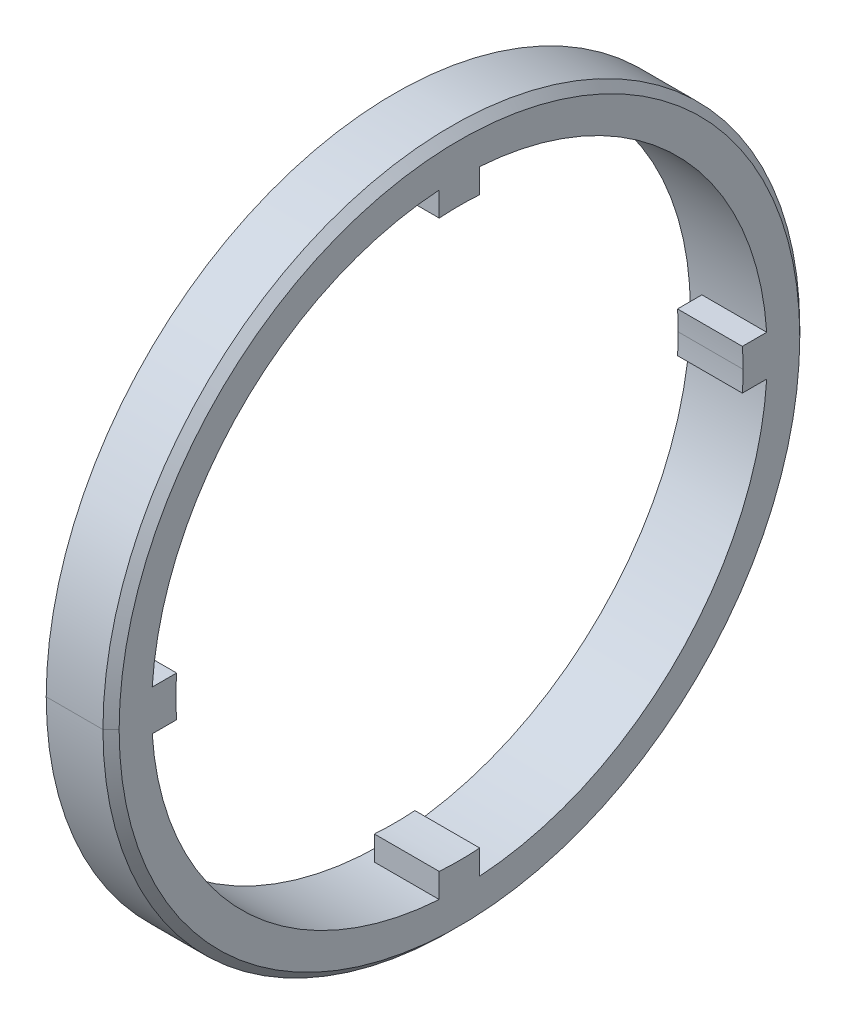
ISO-10303-21;
HEADER;
FILE_DESCRIPTION(('STEP AP214'),'2;1');
FILE_NAME('part.step','',(''),(''),'','','');
FILE_SCHEMA(('AUTOMOTIVE_DESIGN { 1 0 10303 214 1 1 1 1 }'));
ENDSEC;
DATA;
#1=APPLICATION_CONTEXT('core data for automotive mechanical design processes');
#2=APPLICATION_PROTOCOL_DEFINITION('international standard','automotive_design',2000,#1);
#3=PRODUCT_CONTEXT('',#1,'mechanical');
#4=PRODUCT('Part','Part','',(#3));
#5=PRODUCT_RELATED_PRODUCT_CATEGORY('part','',(#4));
#6=PRODUCT_DEFINITION_FORMATION('','',#4);
#7=PRODUCT_DEFINITION_CONTEXT('part definition',#1,'design');
#8=PRODUCT_DEFINITION('design','',#6,#7);
#9=PRODUCT_DEFINITION_SHAPE('','',#8);
#10=(LENGTH_UNIT() NAMED_UNIT(*) SI_UNIT(.MILLI.,.METRE.));
#11=(NAMED_UNIT(*) PLANE_ANGLE_UNIT() SI_UNIT($,.RADIAN.));
#12=(NAMED_UNIT(*) SI_UNIT($,.STERADIAN.) SOLID_ANGLE_UNIT());
#13=UNCERTAINTY_MEASURE_WITH_UNIT(LENGTH_MEASURE(1.E-05),#10,'distance_accuracy_value','');
#14=(GEOMETRIC_REPRESENTATION_CONTEXT(3) GLOBAL_UNCERTAINTY_ASSIGNED_CONTEXT((#13)) GLOBAL_UNIT_ASSIGNED_CONTEXT((#10,
#11,#12)) REPRESENTATION_CONTEXT('',''));
#15=CARTESIAN_POINT('',(0.,0.,0.));
#16=DIRECTION('',(0.,0.,1.));
#17=DIRECTION('',(1.,0.,0.));
#18=AXIS2_PLACEMENT_3D('',#15,#16,#17);
#19=CARTESIAN_POINT('',(-16.,0.,0.));
#20=DIRECTION('',(1.,0.,0.));
#21=DIRECTION('',(0.,1.,0.));
#22=AXIS2_PLACEMENT_3D('',#19,#20,#21);
#23=PLANE('',#22);
#24=CARTESIAN_POINT('',(-16.,0.,0.));
#25=DIRECTION('',(-1.,0.,0.));
#26=DIRECTION('',(0.,1.,0.));
#27=AXIS2_PLACEMENT_3D('',#24,#25,#26);
#28=CIRCLE('',#27,70.);
#29=CARTESIAN_POINT('',(-16.,-4.99999999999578,69.821200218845));
#30=VERTEX_POINT('',#29);
#31=CARTESIAN_POINT('',(-16.,5.00000000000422,69.8212002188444));
#32=VERTEX_POINT('',#31);
#33=EDGE_CURVE('E20',#30,#32,#28,.T.);
#34=ORIENTED_EDGE('',*,*,#33,.F.);
#35=DIRECTION('',(0.,0.,-1.));
#36=VECTOR('',#35,1.);
#37=CARTESIAN_POINT('',(-16.,-4.99999999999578,69.821200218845));
#38=LINE('',#37,#36);
#39=CARTESIAN_POINT('',(-16.,-4.99999999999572,75.8353479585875));
#40=VERTEX_POINT('',#39);
#41=EDGE_CURVE('E26',#40,#30,#38,.T.);
#42=ORIENTED_EDGE('',*,*,#41,.F.);
#43=CARTESIAN_POINT('',(-16.,0.,0.));
#44=DIRECTION('',(1.,0.,0.));
#45=DIRECTION('',(0.,1.,0.));
#46=AXIS2_PLACEMENT_3D('',#43,#44,#45);
#47=CIRCLE('',#46,76.);
#48=CARTESIAN_POINT('',(-16.,0.,76.));
#49=VERTEX_POINT('',#48);
#50=EDGE_CURVE('E313',#49,#40,#47,.T.);
#51=ORIENTED_EDGE('',*,*,#50,.F.);
#52=CARTESIAN_POINT('',(-16.,0.,0.));
#53=DIRECTION('',(1.,0.,0.));
#54=DIRECTION('',(0.,1.,0.));
#55=AXIS2_PLACEMENT_3D('',#52,#53,#54);
#56=CIRCLE('',#55,76.);
#57=CARTESIAN_POINT('',(-16.,5.00000000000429,75.8353479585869));
#58=VERTEX_POINT('',#57);
#59=EDGE_CURVE('E443',#58,#49,#56,.T.);
#60=ORIENTED_EDGE('',*,*,#59,.F.);
#61=DIRECTION('',(0.,0.,1.));
#62=VECTOR('',#61,1.);
#63=CARTESIAN_POINT('',(-16.,5.00000000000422,69.8212002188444));
#64=LINE('',#63,#62);
#65=EDGE_CURVE('E11',#32,#58,#64,.T.);
#66=ORIENTED_EDGE('',*,*,#65,.F.);
#67=EDGE_LOOP('',(#34,#42,#51,#60,#66));
#68=FACE_BOUND('',#67,.T.);
#69=ADVANCED_FACE('F17',(#68),#23,.F.);
#70=CARTESIAN_POINT('',(-16.,5.00000000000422,69.8212002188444));
#71=DIRECTION('',(0.,1.,0.));
#72=DIRECTION('',(0.,0.,-1.));
#73=AXIS2_PLACEMENT_3D('',#70,#71,#72);
#74=PLANE('',#73);
#75=DIRECTION('',(0.,0.,1.));
#76=VECTOR('',#75,1.);
#77=CARTESIAN_POINT('',(0.,5.00000000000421,69.8212002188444));
#78=LINE('',#77,#76);
#79=CARTESIAN_POINT('',(0.,5.00000000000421,69.8212002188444));
#80=VERTEX_POINT('',#79);
#81=CARTESIAN_POINT('',(1.94289029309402E-13,5.00000000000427,75.8353479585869));
#82=VERTEX_POINT('',#81);
#83=EDGE_CURVE('E293',#80,#82,#78,.T.);
#84=ORIENTED_EDGE('',*,*,#83,.F.);
#85=DIRECTION('',(1.,0.,0.));
#86=VECTOR('',#85,1.);
#87=CARTESIAN_POINT('',(-16.,5.00000000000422,69.8212002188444));
#88=LINE('',#87,#86);
#89=EDGE_CURVE('E272',#32,#80,#88,.T.);
#90=ORIENTED_EDGE('',*,*,#89,.F.);
#91=ORIENTED_EDGE('',*,*,#65,.T.);
#92=DIRECTION('',(1.,0.,0.));
#93=VECTOR('',#92,1.);
#94=CARTESIAN_POINT('',(-16.,5.00000000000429,75.8353479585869));
#95=LINE('',#94,#93);
#96=EDGE_CURVE('E439',#58,#82,#95,.T.);
#97=ORIENTED_EDGE('',*,*,#96,.T.);
#98=EDGE_LOOP('',(#84,#90,#91,#97));
#99=FACE_BOUND('',#98,.T.);
#100=ADVANCED_FACE('F583',(#99),#74,.T.);
#101=CARTESIAN_POINT('',(-16.,-4.99999999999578,69.821200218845));
#102=DIRECTION('',(0.,-1.,0.));
#103=DIRECTION('',(-1.,0.,0.));
#104=AXIS2_PLACEMENT_3D('',#101,#102,#103);
#105=PLANE('',#104);
#106=DIRECTION('',(0.,0.,-1.));
#107=VECTOR('',#106,1.);
#108=CARTESIAN_POINT('',(1.11022302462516E-13,-4.99999999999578,69.821200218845));
#109=LINE('',#108,#107);
#110=CARTESIAN_POINT('',(1.11022302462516E-13,-4.99999999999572,75.8353479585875));
#111=VERTEX_POINT('',#110);
#112=CARTESIAN_POINT('',(1.11022302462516E-13,-4.99999999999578,69.821200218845));
#113=VERTEX_POINT('',#112);
#114=EDGE_CURVE('E294',#111,#113,#109,.T.);
#115=ORIENTED_EDGE('',*,*,#114,.F.);
#116=DIRECTION('',(1.,0.,0.));
#117=VECTOR('',#116,1.);
#118=CARTESIAN_POINT('',(-16.,-4.99999999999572,75.8353479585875));
#119=LINE('',#118,#117);
#120=EDGE_CURVE('E309',#40,#111,#119,.T.);
#121=ORIENTED_EDGE('',*,*,#120,.F.);
#122=ORIENTED_EDGE('',*,*,#41,.T.);
#123=DIRECTION('',(1.,0.,0.));
#124=VECTOR('',#123,1.);
#125=CARTESIAN_POINT('',(-16.,-4.99999999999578,69.821200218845));
#126=LINE('',#125,#124);
#127=EDGE_CURVE('E484',#30,#113,#126,.T.);
#128=ORIENTED_EDGE('',*,*,#127,.T.);
#129=EDGE_LOOP('',(#115,#121,#122,#128));
#130=FACE_BOUND('',#129,.T.);
#131=ADVANCED_FACE('F587',(#130),#105,.T.);
#132=CARTESIAN_POINT('',(-16.,0.,0.));
#133=DIRECTION('',(1.,0.,0.));
#134=DIRECTION('',(0.,0.,-1.));
#135=AXIS2_PLACEMENT_3D('',#132,#133,#134);
#136=CYLINDRICAL_SURFACE('',#135,70.);
#137=CARTESIAN_POINT('',(0.,0.,0.));
#138=DIRECTION('',(-1.,0.,0.));
#139=DIRECTION('',(0.,1.,0.));
#140=AXIS2_PLACEMENT_3D('',#137,#138,#139);
#141=CIRCLE('',#140,70.);
#142=EDGE_CURVE('E290',#113,#80,#141,.T.);
#143=ORIENTED_EDGE('',*,*,#142,.F.);
#144=ORIENTED_EDGE('',*,*,#127,.F.);
#145=ORIENTED_EDGE('',*,*,#33,.T.);
#146=ORIENTED_EDGE('',*,*,#89,.T.);
#147=EDGE_LOOP('',(#143,#144,#145,#146));
#148=FACE_BOUND('',#147,.T.);
#149=ADVANCED_FACE('F595',(#148),#136,.F.);
#150=CARTESIAN_POINT('',(-16.,0.,0.));
#151=DIRECTION('',(1.,0.,0.));
#152=DIRECTION('',(0.,1.,0.));
#153=AXIS2_PLACEMENT_3D('',#150,#151,#152);
#154=PLANE('',#153);
#155=CARTESIAN_POINT('',(-16.,0.,0.));
#156=DIRECTION('',(-1.,0.,0.));
#157=DIRECTION('',(0.,0.,1.));
#158=AXIS2_PLACEMENT_3D('',#155,#156,#157);
#159=CIRCLE('',#158,70.);
#160=CARTESIAN_POINT('',(-16.,-69.821200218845,-4.99999999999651));
#161=VERTEX_POINT('',#160);
#162=CARTESIAN_POINT('',(-16.,-69.8212002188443,5.00000000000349));
#163=VERTEX_POINT('',#162);
#164=EDGE_CURVE('E494',#161,#163,#159,.T.);
#165=ORIENTED_EDGE('',*,*,#164,.F.);
#166=DIRECTION('',(0.,1.,0.));
#167=VECTOR('',#166,1.);
#168=CARTESIAN_POINT('',(-16.,-69.821200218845,-4.99999999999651));
#169=LINE('',#168,#167);
#170=CARTESIAN_POINT('',(-16.,-75.8353479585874,-4.99999999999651));
#171=VERTEX_POINT('',#170);
#172=EDGE_CURVE('E285',#171,#161,#169,.T.);
#173=ORIENTED_EDGE('',*,*,#172,.F.);
#174=CARTESIAN_POINT('',(-16.,0.,0.));
#175=DIRECTION('',(1.,0.,0.));
#176=DIRECTION('',(0.,0.,1.));
#177=AXIS2_PLACEMENT_3D('',#174,#175,#176);
#178=CIRCLE('',#177,76.);
#179=CARTESIAN_POINT('',(-16.,-75.8353479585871,5.00000000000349));
#180=VERTEX_POINT('',#179);
#181=EDGE_CURVE('E337',#180,#171,#178,.T.);
#182=ORIENTED_EDGE('',*,*,#181,.F.);
#183=DIRECTION('',(0.,-1.,0.));
#184=VECTOR('',#183,1.);
#185=CARTESIAN_POINT('',(-16.,-69.8212002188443,5.00000000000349));
#186=LINE('',#185,#184);
#187=EDGE_CURVE('E288',#163,#180,#186,.T.);
#188=ORIENTED_EDGE('',*,*,#187,.F.);
#189=EDGE_LOOP('',(#165,#173,#182,#188));
#190=FACE_BOUND('',#189,.T.);
#191=ADVANCED_FACE('F511',(#190),#154,.F.);
#192=CARTESIAN_POINT('',(-16.,-69.8212002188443,5.00000000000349));
#193=DIRECTION('',(0.,0.,1.));
#194=DIRECTION('',(1.,0.,0.));
#195=AXIS2_PLACEMENT_3D('',#192,#193,#194);
#196=PLANE('',#195);
#197=DIRECTION('',(0.,-1.,0.));
#198=VECTOR('',#197,1.);
#199=CARTESIAN_POINT('',(0.,-69.8212002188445,5.00000000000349));
#200=LINE('',#199,#198);
#201=CARTESIAN_POINT('',(0.,-69.8212002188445,5.00000000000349));
#202=VERTEX_POINT('',#201);
#203=CARTESIAN_POINT('',(1.94289029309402E-13,-75.835347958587,5.00000000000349));
#204=VERTEX_POINT('',#203);
#205=EDGE_CURVE('E366',#202,#204,#200,.T.);
#206=ORIENTED_EDGE('',*,*,#205,.F.);
#207=DIRECTION('',(1.,0.,0.));
#208=VECTOR('',#207,1.);
#209=CARTESIAN_POINT('',(-16.,-69.8212002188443,5.00000000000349));
#210=LINE('',#209,#208);
#211=EDGE_CURVE('E289',#163,#202,#210,.T.);
#212=ORIENTED_EDGE('',*,*,#211,.F.);
#213=ORIENTED_EDGE('',*,*,#187,.T.);
#214=DIRECTION('',(1.,0.,0.));
#215=VECTOR('',#214,1.);
#216=CARTESIAN_POINT('',(-16.,-75.8353479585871,5.00000000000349));
#217=LINE('',#216,#215);
#218=EDGE_CURVE('E308',#180,#204,#217,.T.);
#219=ORIENTED_EDGE('',*,*,#218,.T.);
#220=EDGE_LOOP('',(#206,#212,#213,#219));
#221=FACE_BOUND('',#220,.T.);
#222=ADVANCED_FACE('F506',(#221),#196,.T.);
#223=CARTESIAN_POINT('',(-16.,-69.821200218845,-4.99999999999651));
#224=DIRECTION('',(0.,0.,-1.));
#225=DIRECTION('',(0.,-1.,0.));
#226=AXIS2_PLACEMENT_3D('',#223,#224,#225);
#227=PLANE('',#226);
#228=DIRECTION('',(0.,1.,0.));
#229=VECTOR('',#228,1.);
#230=CARTESIAN_POINT('',(0.,-69.8212002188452,-4.99999999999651));
#231=LINE('',#230,#229);
#232=CARTESIAN_POINT('',(1.94289029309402E-13,-75.8353479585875,-4.99999999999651));
#233=VERTEX_POINT('',#232);
#234=CARTESIAN_POINT('',(0.,-69.8212002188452,-4.99999999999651));
#235=VERTEX_POINT('',#234);
#236=EDGE_CURVE('E413',#233,#235,#231,.T.);
#237=ORIENTED_EDGE('',*,*,#236,.F.);
#238=DIRECTION('',(1.,0.,0.));
#239=VECTOR('',#238,1.);
#240=CARTESIAN_POINT('',(-16.,-75.8353479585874,-4.99999999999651));
#241=LINE('',#240,#239);
#242=EDGE_CURVE('E348',#171,#233,#241,.T.);
#243=ORIENTED_EDGE('',*,*,#242,.F.);
#244=ORIENTED_EDGE('',*,*,#172,.T.);
#245=DIRECTION('',(1.,0.,0.));
#246=VECTOR('',#245,1.);
#247=CARTESIAN_POINT('',(-16.,-69.821200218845,-4.99999999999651));
#248=LINE('',#247,#246);
#249=EDGE_CURVE('E491',#161,#235,#248,.T.);
#250=ORIENTED_EDGE('',*,*,#249,.T.);
#251=EDGE_LOOP('',(#237,#243,#244,#250));
#252=FACE_BOUND('',#251,.T.);
#253=ADVANCED_FACE('F523',(#252),#227,.T.);
#254=CARTESIAN_POINT('',(-16.,0.,0.));
#255=DIRECTION('',(1.,0.,0.));
#256=DIRECTION('',(0.,0.,-1.));
#257=AXIS2_PLACEMENT_3D('',#254,#255,#256);
#258=CYLINDRICAL_SURFACE('',#257,70.);
#259=CARTESIAN_POINT('',(0.,0.,0.));
#260=DIRECTION('',(-1.,0.,0.));
#261=DIRECTION('',(0.,0.,1.));
#262=AXIS2_PLACEMENT_3D('',#259,#260,#261);
#263=CIRCLE('',#262,70.);
#264=EDGE_CURVE('E369',#235,#202,#263,.T.);
#265=ORIENTED_EDGE('',*,*,#264,.F.);
#266=ORIENTED_EDGE('',*,*,#249,.F.);
#267=ORIENTED_EDGE('',*,*,#164,.T.);
#268=ORIENTED_EDGE('',*,*,#211,.T.);
#269=EDGE_LOOP('',(#265,#266,#267,#268));
#270=FACE_BOUND('',#269,.T.);
#271=ADVANCED_FACE('F521',(#270),#258,.F.);
#272=CARTESIAN_POINT('',(-16.,0.,0.));
#273=DIRECTION('',(1.,0.,0.));
#274=DIRECTION('',(0.,1.,0.));
#275=AXIS2_PLACEMENT_3D('',#272,#273,#274);
#276=PLANE('',#275);
#277=CARTESIAN_POINT('',(-16.,0.,0.));
#278=DIRECTION('',(-1.,0.,0.));
#279=DIRECTION('',(0.,-1.,0.));
#280=AXIS2_PLACEMENT_3D('',#277,#278,#279);
#281=CIRCLE('',#280,70.);
#282=CARTESIAN_POINT('',(-16.,4.99999999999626,-69.821200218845));
#283=VERTEX_POINT('',#282);
#284=CARTESIAN_POINT('',(-16.,0.,-70.));
#285=VERTEX_POINT('',#284);
#286=EDGE_CURVE('E252',#283,#285,#281,.T.);
#287=ORIENTED_EDGE('',*,*,#286,.F.);
#288=DIRECTION('',(0.,0.,1.));
#289=VECTOR('',#288,1.);
#290=CARTESIAN_POINT('',(-16.,4.99999999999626,-69.821200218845));
#291=LINE('',#290,#289);
#292=CARTESIAN_POINT('',(-16.,4.99999999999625,-75.8353479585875));
#293=VERTEX_POINT('',#292);
#294=EDGE_CURVE('E234',#293,#283,#291,.T.);
#295=ORIENTED_EDGE('',*,*,#294,.F.);
#296=CARTESIAN_POINT('',(-16.,0.,0.));
#297=DIRECTION('',(1.,0.,0.));
#298=DIRECTION('',(0.,-1.,0.));
#299=AXIS2_PLACEMENT_3D('',#296,#297,#298);
#300=CIRCLE('',#299,76.);
#301=CARTESIAN_POINT('',(-16.,0.,-76.));
#302=VERTEX_POINT('',#301);
#303=EDGE_CURVE('E419',#302,#293,#300,.T.);
#304=ORIENTED_EDGE('',*,*,#303,.F.);
#305=CARTESIAN_POINT('',(-16.,0.,0.));
#306=DIRECTION('',(1.,0.,0.));
#307=DIRECTION('',(0.,-1.,0.));
#308=AXIS2_PLACEMENT_3D('',#305,#306,#307);
#309=CIRCLE('',#308,76.);
#310=CARTESIAN_POINT('',(-16.,-5.00000000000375,-75.835347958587));
#311=VERTEX_POINT('',#310);
#312=EDGE_CURVE('E256',#311,#302,#309,.T.);
#313=ORIENTED_EDGE('',*,*,#312,.F.);
#314=DIRECTION('',(0.,0.,-1.));
#315=VECTOR('',#314,1.);
#316=CARTESIAN_POINT('',(-16.,-5.00000000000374,-69.8212002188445));
#317=LINE('',#316,#315);
#318=CARTESIAN_POINT('',(-16.,-5.00000000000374,-69.8212002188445));
#319=VERTEX_POINT('',#318);
#320=EDGE_CURVE('E245',#319,#311,#317,.T.);
#321=ORIENTED_EDGE('',*,*,#320,.F.);
#322=CARTESIAN_POINT('',(-16.,0.,0.));
#323=DIRECTION('',(-1.,0.,0.));
#324=DIRECTION('',(0.,-1.,0.));
#325=AXIS2_PLACEMENT_3D('',#322,#323,#324);
#326=CIRCLE('',#325,70.);
#327=EDGE_CURVE('E260',#285,#319,#326,.T.);
#328=ORIENTED_EDGE('',*,*,#327,.F.);
#329=EDGE_LOOP('',(#287,#295,#304,#313,#321,#328));
#330=FACE_BOUND('',#329,.T.);
#331=ADVANCED_FACE('F258',(#330),#276,.F.);
#332=CARTESIAN_POINT('',(-16.,-5.00000000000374,-69.8212002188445));
#333=DIRECTION('',(0.,-1.,0.));
#334=DIRECTION('',(-1.,0.,0.));
#335=AXIS2_PLACEMENT_3D('',#332,#333,#334);
#336=PLANE('',#335);
#337=DIRECTION('',(0.,0.,-1.));
#338=VECTOR('',#337,1.);
#339=CARTESIAN_POINT('',(0.,-5.00000000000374,-69.8212002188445));
#340=LINE('',#339,#338);
#341=CARTESIAN_POINT('',(0.,-5.00000000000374,-69.8212002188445));
#342=VERTEX_POINT('',#341);
#343=CARTESIAN_POINT('',(0.,-5.00000000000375,-75.835347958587));
#344=VERTEX_POINT('',#343);
#345=EDGE_CURVE('E432',#342,#344,#340,.T.);
#346=ORIENTED_EDGE('',*,*,#345,.F.);
#347=DIRECTION('',(1.,0.,0.));
#348=VECTOR('',#347,1.);
#349=CARTESIAN_POINT('',(-16.,-5.00000000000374,-69.8212002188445));
#350=LINE('',#349,#348);
#351=EDGE_CURVE('E246',#319,#342,#350,.T.);
#352=ORIENTED_EDGE('',*,*,#351,.F.);
#353=ORIENTED_EDGE('',*,*,#320,.T.);
#354=DIRECTION('',(1.,0.,0.));
#355=VECTOR('',#354,1.);
#356=CARTESIAN_POINT('',(-16.,-5.00000000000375,-75.835347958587));
#357=LINE('',#356,#355);
#358=EDGE_CURVE('E275',#311,#344,#357,.T.);
#359=ORIENTED_EDGE('',*,*,#358,.T.);
#360=EDGE_LOOP('',(#346,#352,#353,#359));
#361=FACE_BOUND('',#360,.T.);
#362=ADVANCED_FACE('F530',(#361),#336,.T.);
#363=CARTESIAN_POINT('',(-16.,4.99999999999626,-69.821200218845));
#364=DIRECTION('',(0.,1.,0.));
#365=DIRECTION('',(0.,0.,-1.));
#366=AXIS2_PLACEMENT_3D('',#363,#364,#365);
#367=PLANE('',#366);
#368=DIRECTION('',(0.,0.,1.));
#369=VECTOR('',#368,1.);
#370=CARTESIAN_POINT('',(1.94289029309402E-13,4.99999999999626,-69.821200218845));
#371=LINE('',#370,#369);
#372=CARTESIAN_POINT('',(0.,4.99999999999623,-75.8353479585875));
#373=VERTEX_POINT('',#372);
#374=CARTESIAN_POINT('',(1.94289029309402E-13,4.99999999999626,-69.821200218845));
#375=VERTEX_POINT('',#374);
#376=EDGE_CURVE('E451',#373,#375,#371,.T.);
#377=ORIENTED_EDGE('',*,*,#376,.F.);
#378=DIRECTION('',(1.,0.,0.));
#379=VECTOR('',#378,1.);
#380=CARTESIAN_POINT('',(-16.,4.99999999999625,-75.8353479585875));
#381=LINE('',#380,#379);
#382=EDGE_CURVE('E240',#293,#373,#381,.T.);
#383=ORIENTED_EDGE('',*,*,#382,.F.);
#384=ORIENTED_EDGE('',*,*,#294,.T.);
#385=DIRECTION('',(1.,0.,0.));
#386=VECTOR('',#385,1.);
#387=CARTESIAN_POINT('',(-16.,4.99999999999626,-69.821200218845));
#388=LINE('',#387,#386);
#389=EDGE_CURVE('E237',#283,#375,#388,.T.);
#390=ORIENTED_EDGE('',*,*,#389,.T.);
#391=EDGE_LOOP('',(#377,#383,#384,#390));
#392=FACE_BOUND('',#391,.T.);
#393=ADVANCED_FACE('F236',(#392),#367,.T.);
#394=CARTESIAN_POINT('',(-16.,0.,0.));
#395=DIRECTION('',(1.,0.,0.));
#396=DIRECTION('',(0.,0.,-1.));
#397=AXIS2_PLACEMENT_3D('',#394,#395,#396);
#398=CYLINDRICAL_SURFACE('',#397,70.);
#399=DIRECTION('',(1.,0.,0.));
#400=VECTOR('',#399,1.);
#401=CARTESIAN_POINT('',(-16.,0.,-70.));
#402=LINE('',#401,#400);
#403=CARTESIAN_POINT('',(0.,0.,-70.));
#404=VERTEX_POINT('',#403);
#405=EDGE_CURVE('E263',#285,#404,#402,.T.);
#406=ORIENTED_EDGE('',*,*,#405,.F.);
#407=ORIENTED_EDGE('',*,*,#327,.T.);
#408=ORIENTED_EDGE('',*,*,#351,.T.);
#409=CARTESIAN_POINT('',(0.,0.,0.));
#410=DIRECTION('',(-1.,0.,0.));
#411=DIRECTION('',(0.,-1.,0.));
#412=AXIS2_PLACEMENT_3D('',#409,#410,#411);
#413=CIRCLE('',#412,70.);
#414=EDGE_CURVE('E435',#404,#342,#413,.T.);
#415=ORIENTED_EDGE('',*,*,#414,.F.);
#416=EDGE_LOOP('',(#406,#407,#408,#415));
#417=FACE_BOUND('',#416,.T.);
#418=ADVANCED_FACE('F614',(#417),#398,.F.);
#419=CARTESIAN_POINT('',(-16.,0.,0.));
#420=DIRECTION('',(1.,0.,0.));
#421=DIRECTION('',(0.,1.,0.));
#422=AXIS2_PLACEMENT_3D('',#419,#420,#421);
#423=PLANE('',#422);
#424=CARTESIAN_POINT('',(-16.,0.,0.));
#425=DIRECTION('',(-1.,0.,0.));
#426=DIRECTION('',(0.,0.,-1.));
#427=AXIS2_PLACEMENT_3D('',#424,#425,#426);
#428=CIRCLE('',#427,70.);
#429=CARTESIAN_POINT('',(-16.,69.821200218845,4.99999999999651));
#430=VERTEX_POINT('',#429);
#431=CARTESIAN_POINT('',(-16.,69.8212002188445,-5.00000000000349));
#432=VERTEX_POINT('',#431);
#433=EDGE_CURVE('E430',#430,#432,#428,.T.);
#434=ORIENTED_EDGE('',*,*,#433,.F.);
#435=DIRECTION('',(0.,-1.,0.));
#436=VECTOR('',#435,1.);
#437=CARTESIAN_POINT('',(-16.,69.821200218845,4.99999999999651));
#438=LINE('',#437,#436);
#439=CARTESIAN_POINT('',(-16.,75.8353479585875,4.99999999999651));
#440=VERTEX_POINT('',#439);
#441=EDGE_CURVE('E476',#440,#430,#438,.T.);
#442=ORIENTED_EDGE('',*,*,#441,.F.);
#443=CARTESIAN_POINT('',(-16.,0.,0.));
#444=DIRECTION('',(1.,0.,0.));
#445=DIRECTION('',(0.,0.,-1.));
#446=AXIS2_PLACEMENT_3D('',#443,#444,#445);
#447=CIRCLE('',#446,76.);
#448=CARTESIAN_POINT('',(-16.,75.835347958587,-5.00000000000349));
#449=VERTEX_POINT('',#448);
#450=EDGE_CURVE('E357',#449,#440,#447,.T.);
#451=ORIENTED_EDGE('',*,*,#450,.F.);
#452=DIRECTION('',(0.,1.,0.));
#453=VECTOR('',#452,1.);
#454=CARTESIAN_POINT('',(-16.,69.8212002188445,-5.00000000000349));
#455=LINE('',#454,#453);
#456=EDGE_CURVE('E479',#432,#449,#455,.T.);
#457=ORIENTED_EDGE('',*,*,#456,.F.);
#458=EDGE_LOOP('',(#434,#442,#451,#457));
#459=FACE_BOUND('',#458,.T.);
#460=ADVANCED_FACE('F612',(#459),#423,.F.);
#461=CARTESIAN_POINT('',(-16.,69.8212002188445,-5.00000000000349));
#462=DIRECTION('',(0.,0.,-1.));
#463=DIRECTION('',(0.,-1.,0.));
#464=AXIS2_PLACEMENT_3D('',#461,#462,#463);
#465=PLANE('',#464);
#466=DIRECTION('',(0.,1.,0.));
#467=VECTOR('',#466,1.);
#468=CARTESIAN_POINT('',(1.94289029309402E-13,69.8212002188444,-5.00000000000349));
#469=LINE('',#468,#467);
#470=CARTESIAN_POINT('',(1.94289029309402E-13,69.8212002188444,-5.00000000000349));
#471=VERTEX_POINT('',#470);
#472=CARTESIAN_POINT('',(1.38777878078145E-13,75.8353479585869,-5.00000000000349));
#473=VERTEX_POINT('',#472);
#474=EDGE_CURVE('E431',#471,#473,#469,.T.);
#475=ORIENTED_EDGE('',*,*,#474,.F.);
#476=DIRECTION('',(1.,0.,0.));
#477=VECTOR('',#476,1.);
#478=CARTESIAN_POINT('',(-16.,69.8212002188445,-5.00000000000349));
#479=LINE('',#478,#477);
#480=EDGE_CURVE('E473',#432,#471,#479,.T.);
#481=ORIENTED_EDGE('',*,*,#480,.F.);
#482=ORIENTED_EDGE('',*,*,#456,.T.);
#483=DIRECTION('',(1.,0.,0.));
#484=VECTOR('',#483,1.);
#485=CARTESIAN_POINT('',(-16.,75.835347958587,-5.00000000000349));
#486=LINE('',#485,#484);
#487=EDGE_CURVE('E318',#449,#473,#486,.T.);
#488=ORIENTED_EDGE('',*,*,#487,.T.);
#489=EDGE_LOOP('',(#475,#481,#482,#488));
#490=FACE_BOUND('',#489,.T.);
#491=ADVANCED_FACE('F610',(#490),#465,.T.);
#492=CARTESIAN_POINT('',(-16.,69.821200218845,4.99999999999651));
#493=DIRECTION('',(0.,0.,1.));
#494=DIRECTION('',(1.,0.,0.));
#495=AXIS2_PLACEMENT_3D('',#492,#493,#494);
#496=PLANE('',#495);
#497=DIRECTION('',(0.,-1.,0.));
#498=VECTOR('',#497,1.);
#499=CARTESIAN_POINT('',(1.66533453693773E-13,69.8212002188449,4.99999999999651));
#500=LINE('',#499,#498);
#501=CARTESIAN_POINT('',(0.,75.8353479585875,4.99999999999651));
#502=VERTEX_POINT('',#501);
#503=CARTESIAN_POINT('',(1.66533453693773E-13,69.8212002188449,4.99999999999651));
#504=VERTEX_POINT('',#503);
#505=EDGE_CURVE('E444',#502,#504,#500,.T.);
#506=ORIENTED_EDGE('',*,*,#505,.F.);
#507=DIRECTION('',(1.,0.,0.));
#508=VECTOR('',#507,1.);
#509=CARTESIAN_POINT('',(-16.,75.8353479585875,4.99999999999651));
#510=LINE('',#509,#508);
#511=EDGE_CURVE('E352',#440,#502,#510,.T.);
#512=ORIENTED_EDGE('',*,*,#511,.F.);
#513=ORIENTED_EDGE('',*,*,#441,.T.);
#514=DIRECTION('',(1.,0.,0.));
#515=VECTOR('',#514,1.);
#516=CARTESIAN_POINT('',(-16.,69.821200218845,4.99999999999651));
#517=LINE('',#516,#515);
#518=EDGE_CURVE('E427',#430,#504,#517,.T.);
#519=ORIENTED_EDGE('',*,*,#518,.T.);
#520=EDGE_LOOP('',(#506,#512,#513,#519));
#521=FACE_BOUND('',#520,.T.);
#522=ADVANCED_FACE('F578',(#521),#496,.T.);
#523=CARTESIAN_POINT('',(-16.,0.,0.));
#524=DIRECTION('',(1.,0.,0.));
#525=DIRECTION('',(0.,0.,-1.));
#526=AXIS2_PLACEMENT_3D('',#523,#524,#525);
#527=CYLINDRICAL_SURFACE('',#526,70.);
#528=CARTESIAN_POINT('',(0.,0.,0.));
#529=DIRECTION('',(-1.,0.,0.));
#530=DIRECTION('',(0.,0.,-1.));
#531=AXIS2_PLACEMENT_3D('',#528,#529,#530);
#532=CIRCLE('',#531,70.);
#533=EDGE_CURVE('E448',#504,#471,#532,.T.);
#534=ORIENTED_EDGE('',*,*,#533,.F.);
#535=ORIENTED_EDGE('',*,*,#518,.F.);
#536=ORIENTED_EDGE('',*,*,#433,.T.);
#537=ORIENTED_EDGE('',*,*,#480,.T.);
#538=EDGE_LOOP('',(#534,#535,#536,#537));
#539=FACE_BOUND('',#538,.T.);
#540=ADVANCED_FACE('F570',(#539),#527,.F.);
#541=CARTESIAN_POINT('',(0.,84.,0.));
#542=DIRECTION('',(-1.,0.,0.));
#543=DIRECTION('',(0.,0.,1.));
#544=AXIS2_PLACEMENT_3D('',#541,#542,#543);
#545=PLANE('',#544);
#546=CARTESIAN_POINT('',(0.,0.,0.));
#547=DIRECTION('',(-1.,0.,0.));
#548=DIRECTION('',(0.,0.,1.));
#549=AXIS2_PLACEMENT_3D('',#546,#547,#548);
#550=CIRCLE('',#549,76.);
#551=EDGE_CURVE('E314',#473,#373,#550,.T.);
#552=ORIENTED_EDGE('',*,*,#551,.T.);
#553=ORIENTED_EDGE('',*,*,#376,.T.);
#554=CARTESIAN_POINT('',(0.,0.,0.));
#555=DIRECTION('',(-1.,0.,0.));
#556=DIRECTION('',(0.,-1.,0.));
#557=AXIS2_PLACEMENT_3D('',#554,#555,#556);
#558=CIRCLE('',#557,70.);
#559=EDGE_CURVE('E254',#375,#404,#558,.T.);
#560=ORIENTED_EDGE('',*,*,#559,.T.);
#561=ORIENTED_EDGE('',*,*,#414,.T.);
#562=ORIENTED_EDGE('',*,*,#345,.T.);
#563=CARTESIAN_POINT('',(0.,0.,0.));
#564=DIRECTION('',(-1.,0.,0.));
#565=DIRECTION('',(0.,0.,1.));
#566=AXIS2_PLACEMENT_3D('',#563,#564,#565);
#567=CIRCLE('',#566,76.);
#568=EDGE_CURVE('E280',#344,#233,#567,.T.);
#569=ORIENTED_EDGE('',*,*,#568,.T.);
#570=ORIENTED_EDGE('',*,*,#236,.T.);
#571=ORIENTED_EDGE('',*,*,#264,.T.);
#572=ORIENTED_EDGE('',*,*,#205,.T.);
#573=CARTESIAN_POINT('',(0.,0.,0.));
#574=DIRECTION('',(-1.,0.,0.));
#575=DIRECTION('',(0.,0.,1.));
#576=AXIS2_PLACEMENT_3D('',#573,#574,#575);
#577=CIRCLE('',#576,76.);
#578=EDGE_CURVE('E304',#204,#111,#577,.T.);
#579=ORIENTED_EDGE('',*,*,#578,.T.);
#580=ORIENTED_EDGE('',*,*,#114,.T.);
#581=ORIENTED_EDGE('',*,*,#142,.T.);
#582=ORIENTED_EDGE('',*,*,#83,.T.);
#583=CARTESIAN_POINT('',(0.,0.,0.));
#584=DIRECTION('',(-1.,0.,0.));
#585=DIRECTION('',(0.,0.,1.));
#586=AXIS2_PLACEMENT_3D('',#583,#584,#585);
#587=CIRCLE('',#586,76.);
#588=EDGE_CURVE('E356',#82,#502,#587,.T.);
#589=ORIENTED_EDGE('',*,*,#588,.T.);
#590=ORIENTED_EDGE('',*,*,#505,.T.);
#591=ORIENTED_EDGE('',*,*,#533,.T.);
#592=ORIENTED_EDGE('',*,*,#474,.T.);
#593=EDGE_LOOP('',(#552,#553,#560,#561,#562,#569,#570,#571,#572,#579,#580,#581,#582,#589,#590,
#591,#592));
#594=FACE_BOUND('',#593,.T.);
#595=CARTESIAN_POINT('',(0.,0.,0.));
#596=DIRECTION('',(-1.,0.,0.));
#597=DIRECTION('',(0.,0.,1.));
#598=AXIS2_PLACEMENT_3D('',#595,#596,#597);
#599=CIRCLE('',#598,84.);
#600=CARTESIAN_POINT('',(0.,0.,84.));
#601=VERTEX_POINT('',#600);
#602=CARTESIAN_POINT('',(0.,0.,-84.));
#603=VERTEX_POINT('',#602);
#604=EDGE_CURVE('E387',#601,#603,#599,.T.);
#605=ORIENTED_EDGE('',*,*,#604,.F.);
#606=CARTESIAN_POINT('',(0.,0.,0.));
#607=DIRECTION('',(-1.,0.,0.));
#608=DIRECTION('',(0.,0.,1.));
#609=AXIS2_PLACEMENT_3D('',#606,#607,#608);
#610=CIRCLE('',#609,84.);
#611=EDGE_CURVE('E402',#603,#601,#610,.T.);
#612=ORIENTED_EDGE('',*,*,#611,.F.);
#613=EDGE_LOOP('',(#605,#612));
#614=FACE_BOUND('',#613,.T.);
#615=ADVANCED_FACE('F516',(#594,#614),#545,.F.);
#616=CARTESIAN_POINT('',(-1002.41353750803,0.,0.));
#617=DIRECTION('',(-1.,0.,0.));
#618=DIRECTION('',(0.,0.,1.));
#619=AXIS2_PLACEMENT_3D('',#616,#617,#618);
#620=CYLINDRICAL_SURFACE('',#619,76.);
#621=DIRECTION('',(-1.,0.,0.));
#622=VECTOR('',#621,1.);
#623=CARTESIAN_POINT('',(-1002.41353750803,0.,-76.));
#624=LINE('',#623,#622);
#625=CARTESIAN_POINT('',(-19.,0.,-76.));
#626=VERTEX_POINT('',#625);
#627=EDGE_CURVE('E284',#302,#626,#624,.T.);
#628=ORIENTED_EDGE('',*,*,#627,.F.);
#629=ORIENTED_EDGE('',*,*,#303,.T.);
#630=ORIENTED_EDGE('',*,*,#382,.T.);
#631=ORIENTED_EDGE('',*,*,#551,.F.);
#632=ORIENTED_EDGE('',*,*,#487,.F.);
#633=ORIENTED_EDGE('',*,*,#450,.T.);
#634=ORIENTED_EDGE('',*,*,#511,.T.);
#635=ORIENTED_EDGE('',*,*,#588,.F.);
#636=ORIENTED_EDGE('',*,*,#96,.F.);
#637=ORIENTED_EDGE('',*,*,#59,.T.);
#638=DIRECTION('',(-1.,0.,0.));
#639=VECTOR('',#638,1.);
#640=CARTESIAN_POINT('',(-1002.41353750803,0.,76.));
#641=LINE('',#640,#639);
#642=CARTESIAN_POINT('',(-19.,0.,76.));
#643=VERTEX_POINT('',#642);
#644=EDGE_CURVE('E303',#49,#643,#641,.T.);
#645=ORIENTED_EDGE('',*,*,#644,.T.);
#646=CARTESIAN_POINT('',(-19.,0.,0.));
#647=DIRECTION('',(-1.,0.,0.));
#648=DIRECTION('',(0.,0.,1.));
#649=AXIS2_PLACEMENT_3D('',#646,#647,#648);
#650=CIRCLE('',#649,76.);
#651=EDGE_CURVE('E416',#643,#626,#650,.T.);
#652=ORIENTED_EDGE('',*,*,#651,.T.);
#653=EDGE_LOOP('',(#628,#629,#630,#631,#632,#633,#634,#635,#636,#637,#645,#652));
#654=FACE_BOUND('',#653,.T.);
#655=ADVANCED_FACE('F535',(#654),#620,.F.);
#656=CARTESIAN_POINT('',(-19.,80.,0.));
#657=DIRECTION('',(1.,0.,0.));
#658=DIRECTION('',(0.,1.,0.));
#659=AXIS2_PLACEMENT_3D('',#656,#657,#658);
#660=PLANE('',#659);
#661=ORIENTED_EDGE('',*,*,#651,.F.);
#662=CARTESIAN_POINT('',(-19.,0.,0.));
#663=DIRECTION('',(-1.,0.,0.));
#664=DIRECTION('',(0.,0.,1.));
#665=AXIS2_PLACEMENT_3D('',#662,#663,#664);
#666=CIRCLE('',#665,76.);
#667=EDGE_CURVE('E299',#626,#643,#666,.T.);
#668=ORIENTED_EDGE('',*,*,#667,.F.);
#669=EDGE_LOOP('',(#661,#668));
#670=FACE_BOUND('',#669,.T.);
#671=CARTESIAN_POINT('',(-19.,0.,0.));
#672=DIRECTION('',(-1.,0.,0.));
#673=DIRECTION('',(0.,0.,1.));
#674=AXIS2_PLACEMENT_3D('',#671,#672,#673);
#675=CIRCLE('',#674,80.);
#676=CARTESIAN_POINT('',(-19.,0.,-80.));
#677=VERTEX_POINT('',#676);
#678=CARTESIAN_POINT('',(-19.,0.,80.));
#679=VERTEX_POINT('',#678);
#680=EDGE_CURVE('E409',#677,#679,#675,.T.);
#681=ORIENTED_EDGE('',*,*,#680,.T.);
#682=CARTESIAN_POINT('',(-19.,0.,0.));
#683=DIRECTION('',(-1.,0.,0.));
#684=DIRECTION('',(0.,0.,1.));
#685=AXIS2_PLACEMENT_3D('',#682,#683,#684);
#686=CIRCLE('',#685,80.);
#687=EDGE_CURVE('E279',#679,#677,#686,.T.);
#688=ORIENTED_EDGE('',*,*,#687,.T.);
#689=EDGE_LOOP('',(#681,#688));
#690=FACE_BOUND('',#689,.T.);
#691=ADVANCED_FACE('F537',(#670,#690),#660,.F.);
#692=CARTESIAN_POINT('',(-16.,0.,0.));
#693=DIRECTION('',(1.,0.,0.));
#694=DIRECTION('',(0.,0.,-1.));
#695=AXIS2_PLACEMENT_3D('',#692,#693,#694);
#696=CONICAL_SURFACE('',#695,83.,0.785398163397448);
#697=DIRECTION('',(0.707106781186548,0.,0.707106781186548));
#698=VECTOR('',#697,1.);
#699=CARTESIAN_POINT('',(-16.,0.,83.));
#700=LINE('',#699,#698);
#701=CARTESIAN_POINT('',(-16.,0.,83.));
#702=VERTEX_POINT('',#701);
#703=EDGE_CURVE('E327',#679,#702,#700,.T.);
#704=ORIENTED_EDGE('',*,*,#703,.F.);
#705=ORIENTED_EDGE('',*,*,#680,.F.);
#706=DIRECTION('',(0.707106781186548,0.,-0.707106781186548));
#707=VECTOR('',#706,1.);
#708=CARTESIAN_POINT('',(-16.,0.,-83.));
#709=LINE('',#708,#707);
#710=CARTESIAN_POINT('',(-16.,0.,-83.));
#711=VERTEX_POINT('',#710);
#712=EDGE_CURVE('E326',#677,#711,#709,.T.);
#713=ORIENTED_EDGE('',*,*,#712,.T.);
#714=CARTESIAN_POINT('',(-16.,0.,0.));
#715=DIRECTION('',(-1.,0.,0.));
#716=DIRECTION('',(0.,0.,1.));
#717=AXIS2_PLACEMENT_3D('',#714,#715,#716);
#718=CIRCLE('',#717,83.);
#719=EDGE_CURVE('E361',#711,#702,#718,.T.);
#720=ORIENTED_EDGE('',*,*,#719,.T.);
#721=EDGE_LOOP('',(#704,#705,#713,#720));
#722=FACE_BOUND('',#721,.T.);
#723=ADVANCED_FACE('F540',(#722),#696,.T.);
#724=CARTESIAN_POINT('',(-16.,86.,0.));
#725=DIRECTION('',(1.,0.,0.));
#726=DIRECTION('',(0.,1.,0.));
#727=AXIS2_PLACEMENT_3D('',#724,#725,#726);
#728=PLANE('',#727);
#729=ORIENTED_EDGE('',*,*,#719,.F.);
#730=CARTESIAN_POINT('',(-16.,0.,0.));
#731=DIRECTION('',(-1.,0.,0.));
#732=DIRECTION('',(0.,0.,1.));
#733=AXIS2_PLACEMENT_3D('',#730,#731,#732);
#734=CIRCLE('',#733,83.);
#735=EDGE_CURVE('E322',#702,#711,#734,.T.);
#736=ORIENTED_EDGE('',*,*,#735,.F.);
#737=EDGE_LOOP('',(#729,#736));
#738=FACE_BOUND('',#737,.T.);
#739=CARTESIAN_POINT('',(-16.,0.,0.));
#740=DIRECTION('',(-1.,0.,0.));
#741=DIRECTION('',(0.,0.,1.));
#742=AXIS2_PLACEMENT_3D('',#739,#740,#741);
#743=CIRCLE('',#742,86.);
#744=CARTESIAN_POINT('',(-16.,0.,86.));
#745=VERTEX_POINT('',#744);
#746=CARTESIAN_POINT('',(-16.,0.,-86.));
#747=VERTEX_POINT('',#746);
#748=EDGE_CURVE('E379',#745,#747,#743,.T.);
#749=ORIENTED_EDGE('',*,*,#748,.T.);
#750=CARTESIAN_POINT('',(-16.,0.,0.));
#751=DIRECTION('',(-1.,0.,0.));
#752=DIRECTION('',(0.,0.,1.));
#753=AXIS2_PLACEMENT_3D('',#750,#751,#752);
#754=CIRCLE('',#753,86.);
#755=EDGE_CURVE('E358',#747,#745,#754,.T.);
#756=ORIENTED_EDGE('',*,*,#755,.T.);
#757=EDGE_LOOP('',(#749,#756));
#758=FACE_BOUND('',#757,.T.);
#759=ADVANCED_FACE('F550',(#738,#758),#728,.F.);
#760=CARTESIAN_POINT('',(-1002.41353750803,0.,0.));
#761=DIRECTION('',(-1.,0.,0.));
#762=DIRECTION('',(0.,0.,1.));
#763=AXIS2_PLACEMENT_3D('',#760,#761,#762);
#764=CYLINDRICAL_SURFACE('',#763,86.);
#765=DIRECTION('',(-1.,0.,0.));
#766=VECTOR('',#765,1.);
#767=CARTESIAN_POINT('',(-1002.41353750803,0.,-86.));
#768=LINE('',#767,#766);
#769=CARTESIAN_POINT('',(-1.99999999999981,0.,-86.));
#770=VERTEX_POINT('',#769);
#771=EDGE_CURVE('E344',#770,#747,#768,.T.);
#772=ORIENTED_EDGE('',*,*,#771,.F.);
#773=CARTESIAN_POINT('',(-1.99999999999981,0.,0.));
#774=DIRECTION('',(-1.,0.,0.));
#775=DIRECTION('',(0.,0.,1.));
#776=AXIS2_PLACEMENT_3D('',#773,#774,#775);
#777=CIRCLE('',#776,86.);
#778=CARTESIAN_POINT('',(-1.99999999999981,0.,86.));
#779=VERTEX_POINT('',#778);
#780=EDGE_CURVE('E362',#770,#779,#777,.T.);
#781=ORIENTED_EDGE('',*,*,#780,.T.);
#782=DIRECTION('',(-1.,0.,0.));
#783=VECTOR('',#782,1.);
#784=CARTESIAN_POINT('',(-1002.41353750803,0.,86.));
#785=LINE('',#784,#783);
#786=EDGE_CURVE('E383',#779,#745,#785,.T.);
#787=ORIENTED_EDGE('',*,*,#786,.T.);
#788=ORIENTED_EDGE('',*,*,#755,.F.);
#789=EDGE_LOOP('',(#772,#781,#787,#788));
#790=FACE_BOUND('',#789,.T.);
#791=ADVANCED_FACE('F553',(#790),#764,.T.);
#792=CARTESIAN_POINT('',(0.,0.,0.));
#793=DIRECTION('',(-1.,0.,0.));
#794=DIRECTION('',(0.,0.,1.));
#795=AXIS2_PLACEMENT_3D('',#792,#793,#794);
#796=CONICAL_SURFACE('',#795,84.,0.785398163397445);
#797=DIRECTION('',(-0.70710678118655,0.,-0.707106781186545));
#798=VECTOR('',#797,1.);
#799=CARTESIAN_POINT('',(0.,0.,-84.));
#800=LINE('',#799,#798);
#801=EDGE_CURVE('E394',#603,#770,#800,.T.);
#802=ORIENTED_EDGE('',*,*,#801,.F.);
#803=ORIENTED_EDGE('',*,*,#611,.T.);
#804=DIRECTION('',(-0.70710678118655,0.,0.707106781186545));
#805=VECTOR('',#804,1.);
#806=CARTESIAN_POINT('',(0.,0.,84.));
#807=LINE('',#806,#805);
#808=EDGE_CURVE('E398',#601,#779,#807,.T.);
#809=ORIENTED_EDGE('',*,*,#808,.T.);
#810=ORIENTED_EDGE('',*,*,#780,.F.);
#811=EDGE_LOOP('',(#802,#803,#809,#810));
#812=FACE_BOUND('',#811,.T.);
#813=ADVANCED_FACE('F568',(#812),#796,.T.);
#814=CARTESIAN_POINT('',(0.,0.,0.));
#815=DIRECTION('',(-1.,0.,0.));
#816=DIRECTION('',(0.,0.,1.));
#817=AXIS2_PLACEMENT_3D('',#814,#815,#816);
#818=CONICAL_SURFACE('',#817,84.,0.785398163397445);
#819=ORIENTED_EDGE('',*,*,#604,.T.);
#820=ORIENTED_EDGE('',*,*,#801,.T.);
#821=CARTESIAN_POINT('',(-1.99999999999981,0.,0.));
#822=DIRECTION('',(-1.,0.,0.));
#823=DIRECTION('',(0.,0.,1.));
#824=AXIS2_PLACEMENT_3D('',#821,#822,#823);
#825=CIRCLE('',#824,86.);
#826=EDGE_CURVE('E340',#779,#770,#825,.T.);
#827=ORIENTED_EDGE('',*,*,#826,.F.);
#828=ORIENTED_EDGE('',*,*,#808,.F.);
#829=EDGE_LOOP('',(#819,#820,#827,#828));
#830=FACE_BOUND('',#829,.T.);
#831=ADVANCED_FACE('F564',(#830),#818,.T.);
#832=CARTESIAN_POINT('',(-1002.41353750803,0.,0.));
#833=DIRECTION('',(-1.,0.,0.));
#834=DIRECTION('',(0.,0.,1.));
#835=AXIS2_PLACEMENT_3D('',#832,#833,#834);
#836=CYLINDRICAL_SURFACE('',#835,86.);
#837=ORIENTED_EDGE('',*,*,#826,.T.);
#838=ORIENTED_EDGE('',*,*,#771,.T.);
#839=ORIENTED_EDGE('',*,*,#748,.F.);
#840=ORIENTED_EDGE('',*,*,#786,.F.);
#841=EDGE_LOOP('',(#837,#838,#839,#840));
#842=FACE_BOUND('',#841,.T.);
#843=ADVANCED_FACE('F559',(#842),#836,.T.);
#844=CARTESIAN_POINT('',(-16.,0.,0.));
#845=DIRECTION('',(1.,0.,0.));
#846=DIRECTION('',(0.,0.,-1.));
#847=AXIS2_PLACEMENT_3D('',#844,#845,#846);
#848=CONICAL_SURFACE('',#847,83.,0.785398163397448);
#849=ORIENTED_EDGE('',*,*,#687,.F.);
#850=ORIENTED_EDGE('',*,*,#703,.T.);
#851=ORIENTED_EDGE('',*,*,#735,.T.);
#852=ORIENTED_EDGE('',*,*,#712,.F.);
#853=EDGE_LOOP('',(#849,#850,#851,#852));
#854=FACE_BOUND('',#853,.T.);
#855=ADVANCED_FACE('F548',(#854),#848,.T.);
#856=CARTESIAN_POINT('',(-1002.41353750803,0.,0.));
#857=DIRECTION('',(-1.,0.,0.));
#858=DIRECTION('',(0.,0.,1.));
#859=AXIS2_PLACEMENT_3D('',#856,#857,#858);
#860=CYLINDRICAL_SURFACE('',#859,76.);
#861=ORIENTED_EDGE('',*,*,#312,.T.);
#862=ORIENTED_EDGE('',*,*,#627,.T.);
#863=ORIENTED_EDGE('',*,*,#667,.T.);
#864=ORIENTED_EDGE('',*,*,#644,.F.);
#865=ORIENTED_EDGE('',*,*,#50,.T.);
#866=ORIENTED_EDGE('',*,*,#120,.T.);
#867=ORIENTED_EDGE('',*,*,#578,.F.);
#868=ORIENTED_EDGE('',*,*,#218,.F.);
#869=ORIENTED_EDGE('',*,*,#181,.T.);
#870=ORIENTED_EDGE('',*,*,#242,.T.);
#871=ORIENTED_EDGE('',*,*,#568,.F.);
#872=ORIENTED_EDGE('',*,*,#358,.F.);
#873=EDGE_LOOP('',(#861,#862,#863,#864,#865,#866,#867,#868,#869,#870,#871,#872));
#874=FACE_BOUND('',#873,.T.);
#875=ADVANCED_FACE('F514',(#874),#860,.F.);
#876=CARTESIAN_POINT('',(-16.,0.,0.));
#877=DIRECTION('',(1.,0.,0.));
#878=DIRECTION('',(0.,0.,-1.));
#879=AXIS2_PLACEMENT_3D('',#876,#877,#878);
#880=CYLINDRICAL_SURFACE('',#879,70.);
#881=ORIENTED_EDGE('',*,*,#286,.T.);
#882=ORIENTED_EDGE('',*,*,#405,.T.);
#883=ORIENTED_EDGE('',*,*,#559,.F.);
#884=ORIENTED_EDGE('',*,*,#389,.F.);
#885=EDGE_LOOP('',(#881,#882,#883,#884));
#886=FACE_BOUND('',#885,.T.);
#887=ADVANCED_FACE('F250',(#886),#880,.F.);
#888=CLOSED_SHELL('',(#69,#100,#131,#149,#191,#222,#253,#271,#331,#362,#393,#418,#460,#491,#522,
#540,#615,#655,#691,#723,#759,#791,#813,#831,#843,#855,#875,#887));
#889=MANIFOLD_SOLID_BREP('B1',#888);
#890=ADVANCED_BREP_SHAPE_REPRESENTATION('',(#18,#889),#14);
#891=SHAPE_DEFINITION_REPRESENTATION(#9,#890);
ENDSEC;
END-ISO-10303-21;
